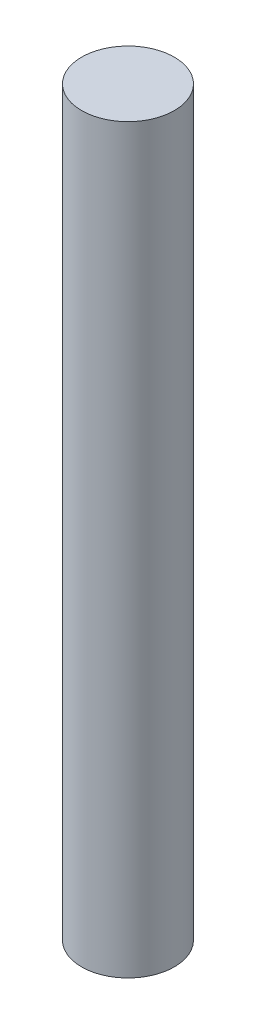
ISO-10303-21;
HEADER;
FILE_DESCRIPTION(('STEP AP214'),'2;1');
FILE_NAME('part.step','',(''),(''),'','','');
FILE_SCHEMA(('AUTOMOTIVE_DESIGN { 1 0 10303 214 1 1 1 1 }'));
ENDSEC;
DATA;
#1=APPLICATION_CONTEXT('core data for automotive mechanical design processes');
#2=APPLICATION_PROTOCOL_DEFINITION('international standard','automotive_design',2000,#1);
#3=PRODUCT_CONTEXT('',#1,'mechanical');
#4=PRODUCT('Part','Part','',(#3));
#5=PRODUCT_RELATED_PRODUCT_CATEGORY('part','',(#4));
#6=PRODUCT_DEFINITION_FORMATION('','',#4);
#7=PRODUCT_DEFINITION_CONTEXT('part definition',#1,'design');
#8=PRODUCT_DEFINITION('design','',#6,#7);
#9=PRODUCT_DEFINITION_SHAPE('','',#8);
#10=(LENGTH_UNIT() NAMED_UNIT(*) SI_UNIT(.MILLI.,.METRE.));
#11=(NAMED_UNIT(*) PLANE_ANGLE_UNIT() SI_UNIT($,.RADIAN.));
#12=(NAMED_UNIT(*) SI_UNIT($,.STERADIAN.) SOLID_ANGLE_UNIT());
#13=UNCERTAINTY_MEASURE_WITH_UNIT(LENGTH_MEASURE(1.E-05),#10,'distance_accuracy_value','');
#14=(GEOMETRIC_REPRESENTATION_CONTEXT(3) GLOBAL_UNCERTAINTY_ASSIGNED_CONTEXT((#13)) GLOBAL_UNIT_ASSIGNED_CONTEXT((#10,
#11,#12)) REPRESENTATION_CONTEXT('',''));
#15=CARTESIAN_POINT('',(0.,0.,0.));
#16=DIRECTION('',(0.,0.,1.));
#17=DIRECTION('',(1.,0.,0.));
#18=AXIS2_PLACEMENT_3D('',#15,#16,#17);
#19=CARTESIAN_POINT('',(-1.66533453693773E-13,127.000000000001,-5.55111512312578E-13));
#20=DIRECTION('',(0.,-1.,0.));
#21=DIRECTION('',(0.,0.,-1.));
#22=AXIS2_PLACEMENT_3D('',#19,#20,#21);
#23=CYLINDRICAL_SURFACE('',#22,7.9375);
#24=CARTESIAN_POINT('',(-1.66533453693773E-13,127.000000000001,-5.55111512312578E-13));
#25=DIRECTION('',(0.,1.,0.));
#26=DIRECTION('',(0.,0.,1.));
#27=AXIS2_PLACEMENT_3D('',#24,#25,#26);
#28=CIRCLE('',#27,7.9375);
#29=CARTESIAN_POINT('',(-1.66533453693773E-13,127.000000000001,7.93749999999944));
#30=VERTEX_POINT('',#29);
#31=EDGE_CURVE('E10',#30,#30,#28,.T.);
#32=ORIENTED_EDGE('',*,*,#31,.F.);
#33=EDGE_LOOP('',(#32));
#34=FACE_BOUND('',#33,.T.);
#35=CARTESIAN_POINT('',(0.,0.,0.));
#36=DIRECTION('',(0.,1.,0.));
#37=DIRECTION('',(0.,0.,1.));
#38=AXIS2_PLACEMENT_3D('',#35,#36,#37);
#39=CIRCLE('',#38,7.9375);
#40=CARTESIAN_POINT('',(0.,0.,7.9375));
#41=VERTEX_POINT('',#40);
#42=EDGE_CURVE('E33',#41,#41,#39,.T.);
#43=ORIENTED_EDGE('',*,*,#42,.T.);
#44=EDGE_LOOP('',(#43));
#45=FACE_BOUND('',#44,.T.);
#46=ADVANCED_FACE('F30',(#34,#45),#23,.T.);
#47=CARTESIAN_POINT('',(-1.66533453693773E-13,127.000000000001,-5.55111512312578E-13));
#48=DIRECTION('',(0.,1.,0.));
#49=DIRECTION('',(0.,0.,1.));
#50=AXIS2_PLACEMENT_3D('',#47,#48,#49);
#51=PLANE('',#50);
#52=ORIENTED_EDGE('',*,*,#31,.T.);
#53=EDGE_LOOP('',(#52));
#54=FACE_BOUND('',#53,.T.);
#55=ADVANCED_FACE('F45',(#54),#51,.T.);
#56=CARTESIAN_POINT('',(0.,0.,0.));
#57=DIRECTION('',(0.,1.,0.));
#58=DIRECTION('',(0.,0.,1.));
#59=AXIS2_PLACEMENT_3D('',#56,#57,#58);
#60=PLANE('',#59);
#61=ORIENTED_EDGE('',*,*,#42,.F.);
#62=EDGE_LOOP('',(#61));
#63=FACE_BOUND('',#62,.T.);
#64=ADVANCED_FACE('F43',(#63),#60,.F.);
#65=CLOSED_SHELL('',(#46,#55,#64));
#66=MANIFOLD_SOLID_BREP('B2',#65);
#67=ADVANCED_BREP_SHAPE_REPRESENTATION('',(#18,#66),#14);
#68=SHAPE_DEFINITION_REPRESENTATION(#9,#67);
ENDSEC;
END-ISO-10303-21;
